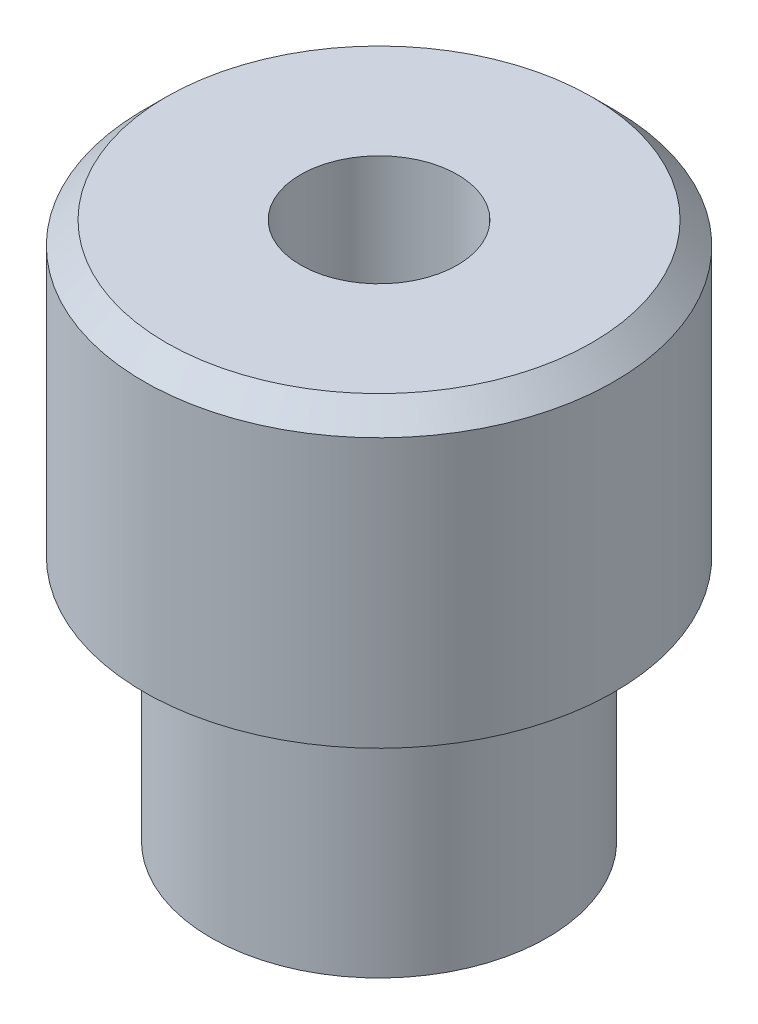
ISO-10303-21;
HEADER;
FILE_DESCRIPTION(('STEP AP214'),'2;1');
FILE_NAME('part.step','',(''),(''),'','','');
FILE_SCHEMA(('AUTOMOTIVE_DESIGN { 1 0 10303 214 1 1 1 1 }'));
ENDSEC;
DATA;
#1=APPLICATION_CONTEXT('core data for automotive mechanical design processes');
#2=APPLICATION_PROTOCOL_DEFINITION('international standard','automotive_design',2000,#1);
#3=PRODUCT_CONTEXT('',#1,'mechanical');
#4=PRODUCT('Part','Part','',(#3));
#5=PRODUCT_RELATED_PRODUCT_CATEGORY('part','',(#4));
#6=PRODUCT_DEFINITION_FORMATION('','',#4);
#7=PRODUCT_DEFINITION_CONTEXT('part definition',#1,'design');
#8=PRODUCT_DEFINITION('design','',#6,#7);
#9=PRODUCT_DEFINITION_SHAPE('','',#8);
#10=(LENGTH_UNIT() NAMED_UNIT(*) SI_UNIT(.MILLI.,.METRE.));
#11=(NAMED_UNIT(*) PLANE_ANGLE_UNIT() SI_UNIT($,.RADIAN.));
#12=(NAMED_UNIT(*) SI_UNIT($,.STERADIAN.) SOLID_ANGLE_UNIT());
#13=UNCERTAINTY_MEASURE_WITH_UNIT(LENGTH_MEASURE(1.E-05),#10,'distance_accuracy_value','');
#14=(GEOMETRIC_REPRESENTATION_CONTEXT(3) GLOBAL_UNCERTAINTY_ASSIGNED_CONTEXT((#13)) GLOBAL_UNIT_ASSIGNED_CONTEXT((#10,
#11,#12)) REPRESENTATION_CONTEXT('',''));
#15=CARTESIAN_POINT('',(0.,0.,0.));
#16=DIRECTION('',(0.,0.,1.));
#17=DIRECTION('',(1.,0.,0.));
#18=AXIS2_PLACEMENT_3D('',#15,#16,#17);
#19=CARTESIAN_POINT('',(0.,11.,0.));
#20=DIRECTION('',(0.,-1.,0.));
#21=DIRECTION('',(0.,0.,-1.));
#22=AXIS2_PLACEMENT_3D('',#19,#20,#21);
#23=CYLINDRICAL_SURFACE('',#22,7.5);
#24=CARTESIAN_POINT('',(0.,9.5,0.));
#25=DIRECTION('',(0.,1.,0.));
#26=DIRECTION('',(0.,0.,1.));
#27=AXIS2_PLACEMENT_3D('',#24,#25,#26);
#28=CIRCLE('',#27,7.5);
#29=CARTESIAN_POINT('',(0.,9.5,7.5));
#30=VERTEX_POINT('',#29);
#31=EDGE_CURVE('E44',#30,#30,#28,.F.);
#32=ORIENTED_EDGE('',*,*,#31,.T.);
#33=EDGE_LOOP('',(#32));
#34=FACE_BOUND('',#33,.T.);
#35=CARTESIAN_POINT('',(0.,0.,0.));
#36=DIRECTION('',(0.,1.,0.));
#37=DIRECTION('',(0.,0.,1.));
#38=AXIS2_PLACEMENT_3D('',#35,#36,#37);
#39=CIRCLE('',#38,7.5);
#40=CARTESIAN_POINT('',(0.,0.,7.5));
#41=VERTEX_POINT('',#40);
#42=EDGE_CURVE('E53',#41,#41,#39,.T.);
#43=ORIENTED_EDGE('',*,*,#42,.T.);
#44=EDGE_LOOP('',(#43));
#45=FACE_BOUND('',#44,.T.);
#46=ADVANCED_FACE('F33',(#34,#45),#23,.T.);
#47=CARTESIAN_POINT('',(0.,0.,0.));
#48=DIRECTION('',(0.,1.,0.));
#49=DIRECTION('',(0.,0.,1.));
#50=AXIS2_PLACEMENT_3D('',#47,#48,#49);
#51=PLANE('',#50);
#52=CARTESIAN_POINT('',(0.,0.,0.));
#53=DIRECTION('',(0.,1.,0.));
#54=DIRECTION('',(0.,0.,1.));
#55=AXIS2_PLACEMENT_3D('',#52,#53,#54);
#56=CIRCLE('',#55,3.5);
#57=CARTESIAN_POINT('',(0.,0.,3.5));
#58=VERTEX_POINT('',#57);
#59=EDGE_CURVE('E59',#58,#58,#56,.T.);
#60=ORIENTED_EDGE('',*,*,#59,.T.);
#61=EDGE_LOOP('',(#60));
#62=FACE_BOUND('',#61,.T.);
#63=ORIENTED_EDGE('',*,*,#42,.F.);
#64=EDGE_LOOP('',(#63));
#65=FACE_BOUND('',#64,.T.);
#66=ADVANCED_FACE('F66',(#62,#65),#51,.F.);
#67=CARTESIAN_POINT('',(0.,11.,0.));
#68=DIRECTION('',(0.,1.,0.));
#69=DIRECTION('',(0.,0.,1.));
#70=AXIS2_PLACEMENT_3D('',#67,#68,#69);
#71=PLANE('',#70);
#72=CARTESIAN_POINT('',(0.,11.,0.));
#73=DIRECTION('',(0.,1.,0.));
#74=DIRECTION('',(0.,0.,1.));
#75=AXIS2_PLACEMENT_3D('',#72,#73,#74);
#76=CIRCLE('',#75,9.99999999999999);
#77=CARTESIAN_POINT('',(0.,11.,9.99999999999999));
#78=VERTEX_POINT('',#77);
#79=EDGE_CURVE('E48',#78,#78,#76,.T.);
#80=ORIENTED_EDGE('',*,*,#79,.T.);
#81=EDGE_LOOP('',(#80));
#82=FACE_BOUND('',#81,.T.);
#83=CARTESIAN_POINT('',(0.,11.,0.));
#84=DIRECTION('',(0.,1.,0.));
#85=DIRECTION('',(0.,0.,1.));
#86=AXIS2_PLACEMENT_3D('',#83,#84,#85);
#87=CIRCLE('',#86,10.5);
#88=CARTESIAN_POINT('',(0.,11.,-10.5));
#89=VERTEX_POINT('',#88);
#90=EDGE_CURVE('E56',#89,#89,#87,.T.);
#91=ORIENTED_EDGE('',*,*,#90,.F.);
#92=EDGE_LOOP('',(#91));
#93=FACE_BOUND('',#92,.T.);
#94=ADVANCED_FACE('F85',(#82,#93),#71,.F.);
#95=CARTESIAN_POINT('',(0.,24.,0.));
#96=DIRECTION('',(0.,-1.,0.));
#97=DIRECTION('',(0.,0.,-1.));
#98=AXIS2_PLACEMENT_3D('',#95,#96,#97);
#99=CYLINDRICAL_SURFACE('',#98,10.5);
#100=CARTESIAN_POINT('',(0.,23.,0.));
#101=DIRECTION('',(0.,1.,0.));
#102=DIRECTION('',(0.,0.,1.));
#103=AXIS2_PLACEMENT_3D('',#100,#101,#102);
#104=CIRCLE('',#103,10.5);
#105=CARTESIAN_POINT('',(0.,23.,-10.5));
#106=VERTEX_POINT('',#105);
#107=EDGE_CURVE('E10',#106,#106,#104,.F.);
#108=CARTESIAN_POINT('',(0.,23.,-10.5));
#109=CARTESIAN_POINT('',(0.,22.875,-10.5));
#110=CARTESIAN_POINT('',(0.,22.75,-10.5));
#111=CARTESIAN_POINT('',(0.,22.5,-10.5));
#112=CARTESIAN_POINT('',(0.,22.375,-10.5));
#113=CARTESIAN_POINT('',(0.,22.125,-10.5));
#114=CARTESIAN_POINT('',(0.,22.,-10.5));
#115=CARTESIAN_POINT('',(0.,21.75,-10.5));
#116=CARTESIAN_POINT('',(0.,21.625,-10.5));
#117=CARTESIAN_POINT('',(0.,21.375,-10.5));
#118=CARTESIAN_POINT('',(0.,21.25,-10.5));
#119=CARTESIAN_POINT('',(0.,21.,-10.5));
#120=CARTESIAN_POINT('',(0.,20.875,-10.5));
#121=CARTESIAN_POINT('',(0.,20.625,-10.5));
#122=CARTESIAN_POINT('',(0.,20.5,-10.5));
#123=CARTESIAN_POINT('',(0.,20.25,-10.5));
#124=CARTESIAN_POINT('',(0.,20.125,-10.5));
#125=CARTESIAN_POINT('',(0.,19.875,-10.5));
#126=CARTESIAN_POINT('',(0.,19.75,-10.5));
#127=CARTESIAN_POINT('',(0.,19.5,-10.5));
#128=CARTESIAN_POINT('',(0.,19.375,-10.5));
#129=CARTESIAN_POINT('',(0.,19.125,-10.5));
#130=CARTESIAN_POINT('',(0.,19.,-10.5));
#131=CARTESIAN_POINT('',(0.,18.75,-10.5));
#132=CARTESIAN_POINT('',(0.,18.625,-10.5));
#133=CARTESIAN_POINT('',(0.,18.375,-10.5));
#134=CARTESIAN_POINT('',(0.,18.25,-10.5));
#135=CARTESIAN_POINT('',(0.,18.,-10.5));
#136=CARTESIAN_POINT('',(0.,17.875,-10.5));
#137=CARTESIAN_POINT('',(0.,17.625,-10.5));
#138=CARTESIAN_POINT('',(0.,17.5,-10.5));
#139=CARTESIAN_POINT('',(0.,17.25,-10.5));
#140=CARTESIAN_POINT('',(0.,17.125,-10.5));
#141=CARTESIAN_POINT('',(0.,16.875,-10.5));
#142=CARTESIAN_POINT('',(0.,16.75,-10.5));
#143=CARTESIAN_POINT('',(0.,16.5,-10.5));
#144=CARTESIAN_POINT('',(0.,16.375,-10.5));
#145=CARTESIAN_POINT('',(0.,16.125,-10.5));
#146=CARTESIAN_POINT('',(0.,16.,-10.5));
#147=CARTESIAN_POINT('',(0.,15.75,-10.5));
#148=CARTESIAN_POINT('',(0.,15.625,-10.5));
#149=CARTESIAN_POINT('',(0.,15.375,-10.5));
#150=CARTESIAN_POINT('',(0.,15.25,-10.5));
#151=CARTESIAN_POINT('',(0.,15.,-10.5));
#152=CARTESIAN_POINT('',(0.,14.875,-10.5));
#153=CARTESIAN_POINT('',(0.,14.625,-10.5));
#154=CARTESIAN_POINT('',(0.,14.5,-10.5));
#155=CARTESIAN_POINT('',(0.,14.25,-10.5));
#156=CARTESIAN_POINT('',(0.,14.125,-10.5));
#157=CARTESIAN_POINT('',(0.,13.875,-10.5));
#158=CARTESIAN_POINT('',(0.,13.75,-10.5));
#159=CARTESIAN_POINT('',(0.,13.5,-10.5));
#160=CARTESIAN_POINT('',(0.,13.375,-10.5));
#161=CARTESIAN_POINT('',(0.,13.125,-10.5));
#162=CARTESIAN_POINT('',(0.,13.,-10.5));
#163=CARTESIAN_POINT('',(0.,12.75,-10.5));
#164=CARTESIAN_POINT('',(0.,12.625,-10.5));
#165=CARTESIAN_POINT('',(0.,12.375,-10.5));
#166=CARTESIAN_POINT('',(0.,12.25,-10.5));
#167=CARTESIAN_POINT('',(0.,12.,-10.5));
#168=CARTESIAN_POINT('',(0.,11.875,-10.5));
#169=CARTESIAN_POINT('',(0.,11.625,-10.5));
#170=CARTESIAN_POINT('',(0.,11.5,-10.5));
#171=CARTESIAN_POINT('',(0.,11.25,-10.5));
#172=CARTESIAN_POINT('',(0.,11.125,-10.5));
#173=CARTESIAN_POINT('',(0.,11.,-10.5));
#174=B_SPLINE_CURVE_WITH_KNOTS('',3,(#108,#109,#110,#111,#112,#113,#114,#115,#116,#117,#118,
#119,#120,#121,#122,#123,#124,#125,#126,#127,#128,#129,#130,#131,#132,#133,#134,#135,#136,#137,
#138,#139,#140,#141,#142,#143,#144,#145,#146,#147,#148,#149,#150,#151,#152,#153,#154,#155,#156,
#157,#158,#159,#160,#161,#162,#163,#164,#165,#166,#167,#168,#169,#170,#171,#172,#173),
.UNSPECIFIED.,.F.,.F.,(4,2,2,2,2,2,2,2,2,2,2,2,2,2,2,2,2,2,2,2,2,2,2,2,2,2,2,2,2,2,2,2,4),(0.,
0.375000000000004,0.750000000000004,1.125,1.5,1.87500000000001,2.25000000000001,
2.62500000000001,3.00000000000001,3.37500000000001,3.75000000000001,4.12500000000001,
4.50000000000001,4.87500000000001,5.25000000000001,5.62500000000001,6.00000000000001,
6.37500000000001,6.75000000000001,7.12500000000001,7.50000000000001,7.87500000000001,
8.25000000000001,8.62500000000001,9.00000000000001,9.37500000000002,9.75000000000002,10.125,
10.5,10.875,11.25,11.625,12.),.UNSPECIFIED.);
#175=EDGE_CURVE('BSEAM78',#106,#89,#174,.T.);
#176=ORIENTED_EDGE('',*,*,#107,.T.);
#177=ORIENTED_EDGE('',*,*,#90,.T.);
#178=ORIENTED_EDGE('',*,*,#175,.T.);
#179=ORIENTED_EDGE('',*,*,#175,.F.);
#180=EDGE_LOOP('',(#176,#178,#177,#179));
#181=FACE_BOUND('',#180,.T.);
#182=ADVANCED_FACE('F78',(#181),#99,.T.);
#183=CARTESIAN_POINT('',(0.,24.,0.));
#184=DIRECTION('',(0.,1.,0.));
#185=DIRECTION('',(0.,0.,1.));
#186=AXIS2_PLACEMENT_3D('',#183,#184,#185);
#187=PLANE('',#186);
#188=CARTESIAN_POINT('',(0.,24.,0.));
#189=DIRECTION('',(0.,1.,0.));
#190=DIRECTION('',(0.,0.,1.));
#191=AXIS2_PLACEMENT_3D('',#188,#189,#190);
#192=CIRCLE('',#191,3.5);
#193=CARTESIAN_POINT('',(0.,24.,3.5));
#194=VERTEX_POINT('',#193);
#195=EDGE_CURVE('E60',#194,#194,#192,.T.);
#196=ORIENTED_EDGE('',*,*,#195,.F.);
#197=EDGE_LOOP('',(#196));
#198=FACE_BOUND('',#197,.T.);
#199=CARTESIAN_POINT('',(0.,24.,0.));
#200=DIRECTION('',(0.,1.,0.));
#201=DIRECTION('',(0.,0.,1.));
#202=AXIS2_PLACEMENT_3D('',#199,#200,#201);
#203=CIRCLE('',#202,9.50000000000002);
#204=CARTESIAN_POINT('',(0.,24.,9.50000000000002));
#205=VERTEX_POINT('',#204);
#206=EDGE_CURVE('E40',#205,#205,#203,.T.);
#207=ORIENTED_EDGE('',*,*,#206,.T.);
#208=EDGE_LOOP('',(#207));
#209=FACE_BOUND('',#208,.T.);
#210=ADVANCED_FACE('F75',(#198,#209),#187,.T.);
#211=CARTESIAN_POINT('',(0.,11.,0.));
#212=DIRECTION('',(0.,1.,0.));
#213=DIRECTION('',(0.,0.,1.));
#214=AXIS2_PLACEMENT_3D('',#211,#212,#213);
#215=CONICAL_SURFACE('',#214,9.99999999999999,1.03037682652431);
#216=CARTESIAN_POINT('',(0.,9.5,7.5));
#217=CARTESIAN_POINT('',(0.,9.515625,7.52604166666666));
#218=CARTESIAN_POINT('',(0.,9.53125,7.55208333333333));
#219=CARTESIAN_POINT('',(0.,9.5625,7.60416666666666));
#220=CARTESIAN_POINT('',(0.,9.578125,7.63020833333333));
#221=CARTESIAN_POINT('',(0.,9.609375,7.68229166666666));
#222=CARTESIAN_POINT('',(0.,9.625,7.70833333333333));
#223=CARTESIAN_POINT('',(0.,9.65625,7.76041666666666));
#224=CARTESIAN_POINT('',(0.,9.671875,7.78645833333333));
#225=CARTESIAN_POINT('',(0.,9.703125,7.83854166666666));
#226=CARTESIAN_POINT('',(0.,9.71875,7.86458333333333));
#227=CARTESIAN_POINT('',(0.,9.75,7.91666666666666));
#228=CARTESIAN_POINT('',(0.,9.765625,7.94270833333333));
#229=CARTESIAN_POINT('',(0.,9.796875,7.99479166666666));
#230=CARTESIAN_POINT('',(0.,9.8125,8.02083333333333));
#231=CARTESIAN_POINT('',(0.,9.84375,8.07291666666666));
#232=CARTESIAN_POINT('',(0.,9.859375,8.09895833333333));
#233=CARTESIAN_POINT('',(0.,9.890625,8.15104166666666));
#234=CARTESIAN_POINT('',(0.,9.90625,8.17708333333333));
#235=CARTESIAN_POINT('',(0.,9.9375,8.22916666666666));
#236=CARTESIAN_POINT('',(0.,9.953125,8.25520833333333));
#237=CARTESIAN_POINT('',(0.,9.984375,8.30729166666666));
#238=CARTESIAN_POINT('',(0.,10.,8.33333333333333));
#239=CARTESIAN_POINT('',(0.,10.03125,8.38541666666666));
#240=CARTESIAN_POINT('',(0.,10.046875,8.41145833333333));
#241=CARTESIAN_POINT('',(0.,10.078125,8.46354166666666));
#242=CARTESIAN_POINT('',(0.,10.09375,8.48958333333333));
#243=CARTESIAN_POINT('',(0.,10.125,8.54166666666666));
#244=CARTESIAN_POINT('',(0.,10.140625,8.56770833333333));
#245=CARTESIAN_POINT('',(0.,10.171875,8.61979166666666));
#246=CARTESIAN_POINT('',(0.,10.1875,8.64583333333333));
#247=CARTESIAN_POINT('',(0.,10.21875,8.69791666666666));
#248=CARTESIAN_POINT('',(0.,10.234375,8.72395833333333));
#249=CARTESIAN_POINT('',(0.,10.265625,8.77604166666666));
#250=CARTESIAN_POINT('',(0.,10.28125,8.80208333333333));
#251=CARTESIAN_POINT('',(0.,10.3125,8.85416666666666));
#252=CARTESIAN_POINT('',(0.,10.328125,8.88020833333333));
#253=CARTESIAN_POINT('',(0.,10.359375,8.93229166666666));
#254=CARTESIAN_POINT('',(0.,10.375,8.95833333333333));
#255=CARTESIAN_POINT('',(0.,10.40625,9.01041666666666));
#256=CARTESIAN_POINT('',(0.,10.421875,9.03645833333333));
#257=CARTESIAN_POINT('',(0.,10.453125,9.08854166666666));
#258=CARTESIAN_POINT('',(0.,10.46875,9.11458333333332));
#259=CARTESIAN_POINT('',(0.,10.5,9.16666666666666));
#260=CARTESIAN_POINT('',(0.,10.515625,9.19270833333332));
#261=CARTESIAN_POINT('',(0.,10.546875,9.24479166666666));
#262=CARTESIAN_POINT('',(0.,10.5625,9.27083333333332));
#263=CARTESIAN_POINT('',(0.,10.59375,9.32291666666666));
#264=CARTESIAN_POINT('',(0.,10.609375,9.34895833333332));
#265=CARTESIAN_POINT('',(0.,10.640625,9.40104166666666));
#266=CARTESIAN_POINT('',(0.,10.65625,9.42708333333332));
#267=CARTESIAN_POINT('',(0.,10.6875,9.47916666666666));
#268=CARTESIAN_POINT('',(0.,10.703125,9.50520833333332));
#269=CARTESIAN_POINT('',(0.,10.734375,9.55729166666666));
#270=CARTESIAN_POINT('',(0.,10.75,9.58333333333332));
#271=CARTESIAN_POINT('',(0.,10.78125,9.63541666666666));
#272=CARTESIAN_POINT('',(0.,10.796875,9.66145833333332));
#273=CARTESIAN_POINT('',(0.,10.828125,9.71354166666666));
#274=CARTESIAN_POINT('',(0.,10.84375,9.73958333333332));
#275=CARTESIAN_POINT('',(0.,10.875,9.79166666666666));
#276=CARTESIAN_POINT('',(0.,10.890625,9.81770833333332));
#277=CARTESIAN_POINT('',(0.,10.921875,9.86979166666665));
#278=CARTESIAN_POINT('',(0.,10.9375,9.89583333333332));
#279=CARTESIAN_POINT('',(0.,10.96875,9.94791666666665));
#280=CARTESIAN_POINT('',(0.,10.984375,9.97395833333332));
#281=CARTESIAN_POINT('',(0.,11.,9.99999999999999));
#282=B_SPLINE_CURVE_WITH_KNOTS('',3,(#216,#217,#218,#219,#220,#221,#222,#223,#224,#225,#226,
#227,#228,#229,#230,#231,#232,#233,#234,#235,#236,#237,#238,#239,#240,#241,#242,#243,#244,#245,
#246,#247,#248,#249,#250,#251,#252,#253,#254,#255,#256,#257,#258,#259,#260,#261,#262,#263,#264,
#265,#266,#267,#268,#269,#270,#271,#272,#273,#274,#275,#276,#277,#278,#279,#280,#281),
.UNSPECIFIED.,.F.,.F.,(4,2,2,2,2,2,2,2,2,2,2,2,2,2,2,2,2,2,2,2,2,2,2,2,2,2,2,2,2,2,2,2,4),(0.,
0.0911086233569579,0.182217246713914,0.273325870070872,0.364434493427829,0.455543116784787,
0.546651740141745,0.637760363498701,0.728868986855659,0.819977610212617,0.911086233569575,
1.00219485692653,1.09330348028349,1.18441210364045,1.2755207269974,1.36662935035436,
1.45773797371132,1.54884659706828,1.63995522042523,1.73106384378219,1.82217246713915,
1.91328109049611,2.00438971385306,2.09549833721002,2.18660696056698,2.27771558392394,
2.36882420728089,2.45993283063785,2.55104145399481,2.64215007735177,2.73325870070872,
2.82436732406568,2.91547594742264),.UNSPECIFIED.);
#283=EDGE_CURVE('BSEAM77',#30,#78,#282,.T.);
#284=ORIENTED_EDGE('',*,*,#31,.F.);
#285=ORIENTED_EDGE('',*,*,#79,.F.);
#286=ORIENTED_EDGE('',*,*,#283,.T.);
#287=ORIENTED_EDGE('',*,*,#283,.F.);
#288=EDGE_LOOP('',(#284,#286,#285,#287));
#289=FACE_BOUND('',#288,.T.);
#290=ADVANCED_FACE('F77',(#289),#215,.T.);
#291=CARTESIAN_POINT('',(0.,24.,0.));
#292=DIRECTION('',(0.,-1.,0.));
#293=DIRECTION('',(0.,0.,-1.));
#294=AXIS2_PLACEMENT_3D('',#291,#292,#293);
#295=CONICAL_SURFACE('',#294,9.50000000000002,0.785398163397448);
#296=ORIENTED_EDGE('',*,*,#107,.F.);
#297=EDGE_LOOP('',(#296));
#298=FACE_BOUND('',#297,.T.);
#299=ORIENTED_EDGE('',*,*,#206,.F.);
#300=EDGE_LOOP('',(#299));
#301=FACE_BOUND('',#300,.T.);
#302=ADVANCED_FACE('F35',(#298,#301),#295,.T.);
#303=CARTESIAN_POINT('',(0.,0.,0.));
#304=DIRECTION('',(0.,1.,0.));
#305=DIRECTION('',(0.,0.,1.));
#306=AXIS2_PLACEMENT_3D('',#303,#304,#305);
#307=CYLINDRICAL_SURFACE('',#306,3.5);
#308=ORIENTED_EDGE('',*,*,#59,.F.);
#309=EDGE_LOOP('',(#308));
#310=FACE_BOUND('',#309,.T.);
#311=ORIENTED_EDGE('',*,*,#195,.T.);
#312=EDGE_LOOP('',(#311));
#313=FACE_BOUND('',#312,.T.);
#314=ADVANCED_FACE('F69',(#310,#313),#307,.F.);
#315=CLOSED_SHELL('',(#46,#66,#94,#182,#210,#290,#302,#314));
#316=MANIFOLD_SOLID_BREP('B2',#315);
#317=ADVANCED_BREP_SHAPE_REPRESENTATION('',(#18,#316),#14);
#318=SHAPE_DEFINITION_REPRESENTATION(#9,#317);
ENDSEC;
END-ISO-10303-21;
